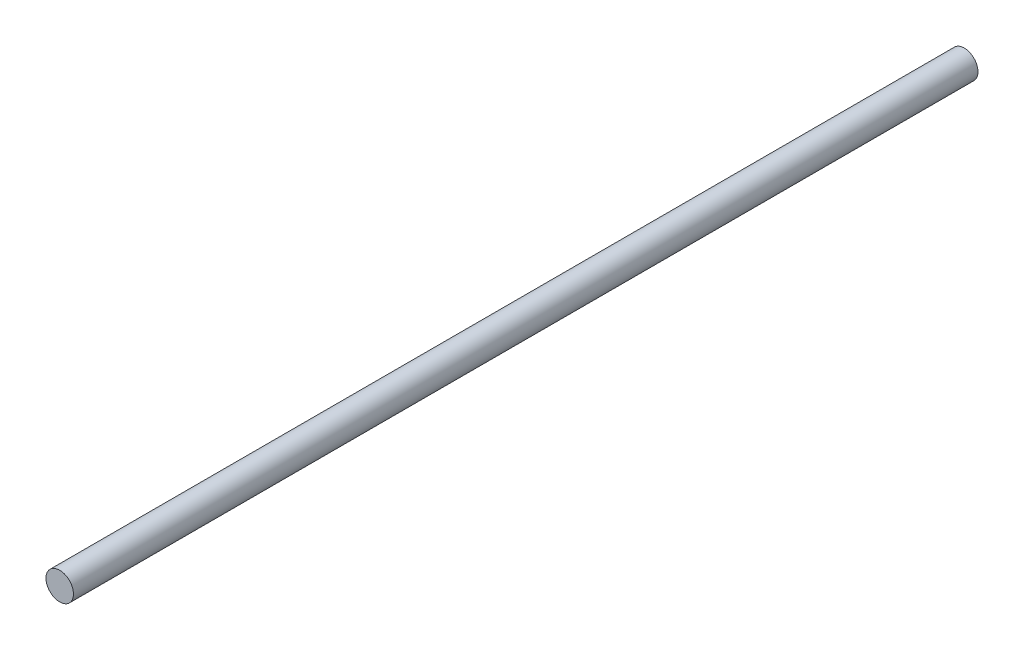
ISO-10303-21;
HEADER;
FILE_DESCRIPTION(('STEP AP214'),'2;1');
FILE_NAME('part.step','',(''),(''),'','','');
FILE_SCHEMA(('AUTOMOTIVE_DESIGN { 1 0 10303 214 1 1 1 1 }'));
ENDSEC;
DATA;
#1=APPLICATION_CONTEXT('core data for automotive mechanical design processes');
#2=APPLICATION_PROTOCOL_DEFINITION('international standard','automotive_design',2000,#1);
#3=PRODUCT_CONTEXT('',#1,'mechanical');
#4=PRODUCT('Part','Part','',(#3));
#5=PRODUCT_RELATED_PRODUCT_CATEGORY('part','',(#4));
#6=PRODUCT_DEFINITION_FORMATION('','',#4);
#7=PRODUCT_DEFINITION_CONTEXT('part definition',#1,'design');
#8=PRODUCT_DEFINITION('design','',#6,#7);
#9=PRODUCT_DEFINITION_SHAPE('','',#8);
#10=(LENGTH_UNIT() NAMED_UNIT(*) SI_UNIT(.MILLI.,.METRE.));
#11=(NAMED_UNIT(*) PLANE_ANGLE_UNIT() SI_UNIT($,.RADIAN.));
#12=(NAMED_UNIT(*) SI_UNIT($,.STERADIAN.) SOLID_ANGLE_UNIT());
#13=UNCERTAINTY_MEASURE_WITH_UNIT(LENGTH_MEASURE(1.E-05),#10,'distance_accuracy_value','');
#14=(GEOMETRIC_REPRESENTATION_CONTEXT(3) GLOBAL_UNCERTAINTY_ASSIGNED_CONTEXT((#13)) GLOBAL_UNIT_ASSIGNED_CONTEXT((#10,
#11,#12)) REPRESENTATION_CONTEXT('',''));
#15=CARTESIAN_POINT('',(0.,0.,0.));
#16=DIRECTION('',(0.,0.,1.));
#17=DIRECTION('',(1.,0.,0.));
#18=AXIS2_PLACEMENT_3D('',#15,#16,#17);
#19=CARTESIAN_POINT('',(0.,0.,209.));
#20=DIRECTION('',(0.,0.,-1.));
#21=DIRECTION('',(-1.,0.,0.));
#22=AXIS2_PLACEMENT_3D('',#19,#20,#21);
#23=CYLINDRICAL_SURFACE('',#22,3.175);
#24=CARTESIAN_POINT('',(0.,0.,209.));
#25=DIRECTION('',(0.,0.,1.));
#26=DIRECTION('',(1.,0.,0.));
#27=AXIS2_PLACEMENT_3D('',#24,#25,#26);
#28=CIRCLE('',#27,3.175);
#29=CARTESIAN_POINT('',(3.175,0.,209.));
#30=VERTEX_POINT('',#29);
#31=EDGE_CURVE('E10',#30,#30,#28,.T.);
#32=ORIENTED_EDGE('',*,*,#31,.F.);
#33=EDGE_LOOP('',(#32));
#34=FACE_BOUND('',#33,.T.);
#35=CARTESIAN_POINT('',(0.,0.,0.));
#36=DIRECTION('',(0.,0.,1.));
#37=DIRECTION('',(1.,0.,0.));
#38=AXIS2_PLACEMENT_3D('',#35,#36,#37);
#39=CIRCLE('',#38,3.175);
#40=CARTESIAN_POINT('',(3.175,0.,0.));
#41=VERTEX_POINT('',#40);
#42=EDGE_CURVE('E32',#41,#41,#39,.T.);
#43=ORIENTED_EDGE('',*,*,#42,.T.);
#44=EDGE_LOOP('',(#43));
#45=FACE_BOUND('',#44,.T.);
#46=ADVANCED_FACE('F29',(#34,#45),#23,.T.);
#47=CARTESIAN_POINT('',(0.,0.,209.));
#48=DIRECTION('',(0.,0.,1.));
#49=DIRECTION('',(1.,0.,0.));
#50=AXIS2_PLACEMENT_3D('',#47,#48,#49);
#51=PLANE('',#50);
#52=ORIENTED_EDGE('',*,*,#31,.T.);
#53=EDGE_LOOP('',(#52));
#54=FACE_BOUND('',#53,.T.);
#55=ADVANCED_FACE('F44',(#54),#51,.T.);
#56=CARTESIAN_POINT('',(0.,0.,0.));
#57=DIRECTION('',(0.,0.,1.));
#58=DIRECTION('',(1.,0.,0.));
#59=AXIS2_PLACEMENT_3D('',#56,#57,#58);
#60=PLANE('',#59);
#61=ORIENTED_EDGE('',*,*,#42,.F.);
#62=EDGE_LOOP('',(#61));
#63=FACE_BOUND('',#62,.T.);
#64=ADVANCED_FACE('F42',(#63),#60,.F.);
#65=CLOSED_SHELL('',(#46,#55,#64));
#66=MANIFOLD_SOLID_BREP('B2',#65);
#67=ADVANCED_BREP_SHAPE_REPRESENTATION('',(#18,#66),#14);
#68=SHAPE_DEFINITION_REPRESENTATION(#9,#67);
ENDSEC;
END-ISO-10303-21;
